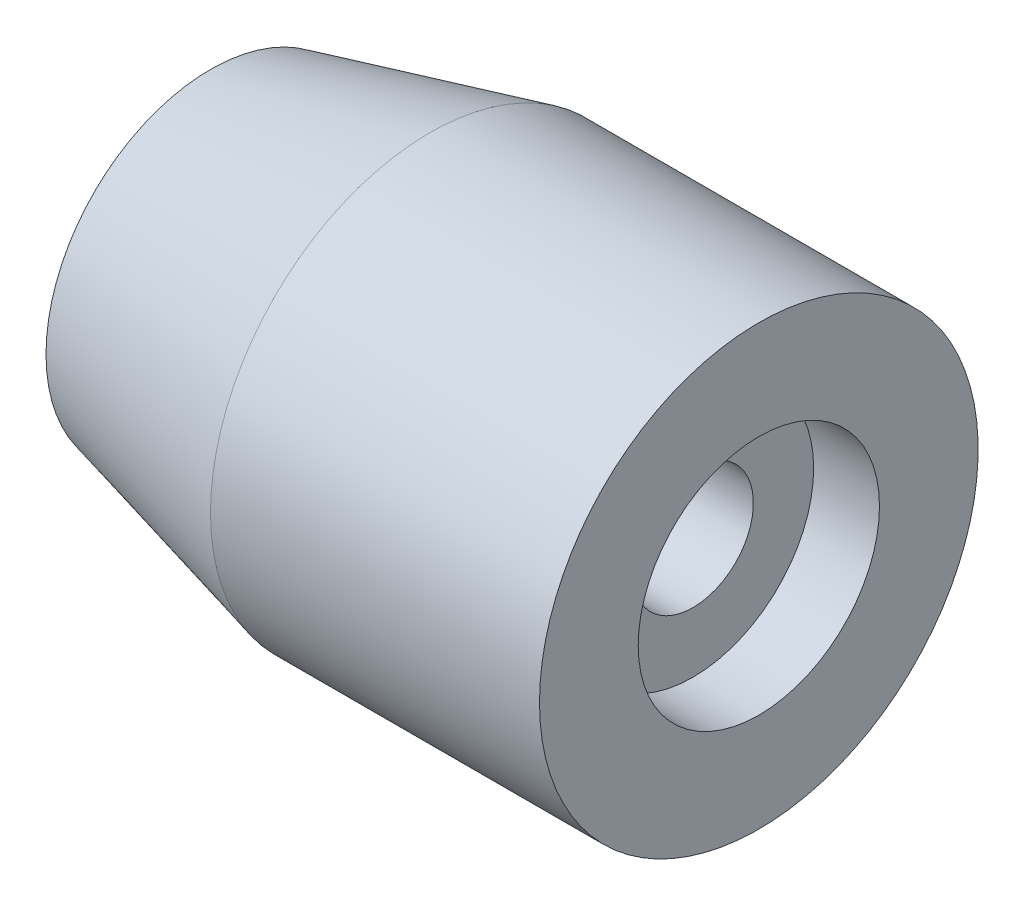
from build123d import *


with BuildPart() as part:
    # Esquisse1 → R_volution1 (revolve)
    with BuildSketch(Plane.XY, mode=Mode.PRIVATE) as r_volution1_sk:
        Polygon((-18.41285632, 2.75), (3.58714368, 2.75), (3.58714368, 5.5), (6.58714368, 5.5), (6.58714368, 10), (-8.41285632, 10), (-18.41285632, 7.5), align=None)
    revolve(r_volution1_sk.sketch.rotate(Axis((-7.013753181, 0, 0), (1, 0, 0)), 90), axis=Axis((-7.013753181, 0, 0), (1, 0, 0)))


solid = part.part
